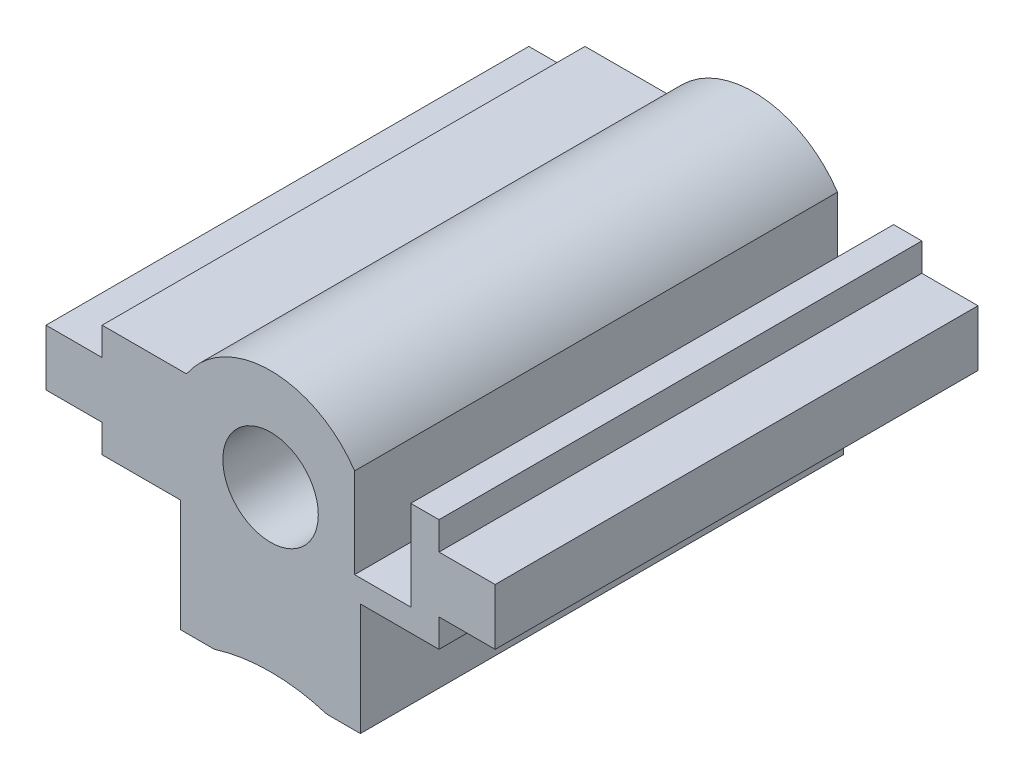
ISO-10303-21;
HEADER;
FILE_DESCRIPTION(('STEP AP214'),'2;1');
FILE_NAME('part.step','',(''),(''),'','','');
FILE_SCHEMA(('AUTOMOTIVE_DESIGN { 1 0 10303 214 1 1 1 1 }'));
ENDSEC;
DATA;
#1=APPLICATION_CONTEXT('core data for automotive mechanical design processes');
#2=APPLICATION_PROTOCOL_DEFINITION('international standard','automotive_design',2000,#1);
#3=PRODUCT_CONTEXT('',#1,'mechanical');
#4=PRODUCT('Part','Part','',(#3));
#5=PRODUCT_RELATED_PRODUCT_CATEGORY('part','',(#4));
#6=PRODUCT_DEFINITION_FORMATION('','',#4);
#7=PRODUCT_DEFINITION_CONTEXT('part definition',#1,'design');
#8=PRODUCT_DEFINITION('design','',#6,#7);
#9=PRODUCT_DEFINITION_SHAPE('','',#8);
#10=(LENGTH_UNIT() NAMED_UNIT(*) SI_UNIT(.MILLI.,.METRE.));
#11=(NAMED_UNIT(*) PLANE_ANGLE_UNIT() SI_UNIT($,.RADIAN.));
#12=(NAMED_UNIT(*) SI_UNIT($,.STERADIAN.) SOLID_ANGLE_UNIT());
#13=UNCERTAINTY_MEASURE_WITH_UNIT(LENGTH_MEASURE(1.E-05),#10,'distance_accuracy_value','');
#14=(GEOMETRIC_REPRESENTATION_CONTEXT(3) GLOBAL_UNCERTAINTY_ASSIGNED_CONTEXT((#13)) GLOBAL_UNIT_ASSIGNED_CONTEXT((#10,
#11,#12)) REPRESENTATION_CONTEXT('',''));
#15=CARTESIAN_POINT('',(0.,0.,0.));
#16=DIRECTION('',(0.,0.,1.));
#17=DIRECTION('',(1.,0.,0.));
#18=AXIS2_PLACEMENT_3D('',#15,#16,#17);
#19=CARTESIAN_POINT('',(-15.,5.,43.));
#20=DIRECTION('',(0.,-1.,0.));
#21=DIRECTION('',(0.,0.,-1.));
#22=AXIS2_PLACEMENT_3D('',#19,#20,#21);
#23=PLANE('',#22);
#24=DIRECTION('',(0.,0.,-1.));
#25=VECTOR('',#24,1.);
#26=CARTESIAN_POINT('',(-7.48331477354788,5.,58.4919333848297));
#27=LINE('',#26,#25);
#28=CARTESIAN_POINT('',(-7.48331477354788,5.,43.));
#29=VERTEX_POINT('',#28);
#30=CARTESIAN_POINT('',(-7.48331477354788,5.,0.));
#31=VERTEX_POINT('',#30);
#32=EDGE_CURVE('E490',#29,#31,#27,.T.);
#33=ORIENTED_EDGE('',*,*,#32,.T.);
#34=DIRECTION('',(-1.,0.,0.));
#35=VECTOR('',#34,1.);
#36=CARTESIAN_POINT('',(-15.,5.,0.));
#37=LINE('',#36,#35);
#38=CARTESIAN_POINT('',(-15.,5.,0.));
#39=VERTEX_POINT('',#38);
#40=EDGE_CURVE('E282',#31,#39,#37,.T.);
#41=ORIENTED_EDGE('',*,*,#40,.T.);
#42=DIRECTION('',(0.,0.,-1.));
#43=VECTOR('',#42,1.);
#44=CARTESIAN_POINT('',(-15.,5.,43.));
#45=LINE('',#44,#43);
#46=CARTESIAN_POINT('',(-15.,5.,43.));
#47=VERTEX_POINT('',#46);
#48=EDGE_CURVE('E397',#47,#39,#45,.T.);
#49=ORIENTED_EDGE('',*,*,#48,.F.);
#50=DIRECTION('',(-1.,0.,0.));
#51=VECTOR('',#50,1.);
#52=CARTESIAN_POINT('',(-15.,5.,43.));
#53=LINE('',#52,#51);
#54=EDGE_CURVE('E48',#29,#47,#53,.T.);
#55=ORIENTED_EDGE('',*,*,#54,.F.);
#56=EDGE_LOOP('',(#33,#41,#49,#55));
#57=FACE_BOUND('',#56,.T.);
#58=ADVANCED_FACE('F33',(#57),#23,.F.);
#59=CARTESIAN_POINT('',(15.,5.,0.));
#60=VERTEX_POINT('',#59);
#61=CARTESIAN_POINT('',(12.4833147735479,5.,0.));
#62=VERTEX_POINT('',#61);
#63=EDGE_CURVE('E275',#60,#62,#37,.T.);
#64=ORIENTED_EDGE('',*,*,#63,.T.);
#65=DIRECTION('',(0.,0.,1.));
#66=VECTOR('',#65,1.);
#67=CARTESIAN_POINT('',(12.4833147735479,5.,-0.001000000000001));
#68=LINE('',#67,#66);
#69=CARTESIAN_POINT('',(12.4833147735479,5.,43.));
#70=VERTEX_POINT('',#69);
#71=EDGE_CURVE('E255',#62,#70,#68,.T.);
#72=ORIENTED_EDGE('',*,*,#71,.T.);
#73=CARTESIAN_POINT('',(15.,5.,43.));
#74=VERTEX_POINT('',#73);
#75=EDGE_CURVE('E440',#74,#70,#53,.T.);
#76=ORIENTED_EDGE('',*,*,#75,.F.);
#77=DIRECTION('',(0.,0.,-1.));
#78=VECTOR('',#77,1.);
#79=CARTESIAN_POINT('',(15.,5.,43.));
#80=LINE('',#79,#78);
#81=EDGE_CURVE('E280',#74,#60,#80,.T.);
#82=ORIENTED_EDGE('',*,*,#81,.T.);
#83=EDGE_LOOP('',(#64,#72,#76,#82));
#84=FACE_BOUND('',#83,.T.);
#85=ADVANCED_FACE('F278',(#84),#23,.F.);
#86=CARTESIAN_POINT('',(-5.,-12.,43.));
#87=DIRECTION('',(0.,1.,0.));
#88=DIRECTION('',(0.,0.,1.));
#89=AXIS2_PLACEMENT_3D('',#86,#87,#88);
#90=PLANE('',#89);
#91=DIRECTION('',(-1.,0.,0.));
#92=VECTOR('',#91,1.);
#93=CARTESIAN_POINT('',(5.,-12.,3.));
#94=LINE('',#93,#92);
#95=CARTESIAN_POINT('',(-2.,-12.,3.));
#96=VERTEX_POINT('',#95);
#97=CARTESIAN_POINT('',(-5.,-12.,3.));
#98=VERTEX_POINT('',#97);
#99=EDGE_CURVE('E486',#96,#98,#94,.T.);
#100=ORIENTED_EDGE('',*,*,#99,.F.);
#101=DIRECTION('',(0.,0.,-1.));
#102=VECTOR('',#101,1.);
#103=CARTESIAN_POINT('',(-2.,-12.,43.));
#104=LINE('',#103,#102);
#105=CARTESIAN_POINT('',(-2.,-12.,40.));
#106=VERTEX_POINT('',#105);
#107=EDGE_CURVE('E369',#106,#96,#104,.T.);
#108=ORIENTED_EDGE('',*,*,#107,.F.);
#109=DIRECTION('',(1.,0.,0.));
#110=VECTOR('',#109,1.);
#111=CARTESIAN_POINT('',(-5.,-12.,40.));
#112=LINE('',#111,#110);
#113=CARTESIAN_POINT('',(-5.,-12.,40.));
#114=VERTEX_POINT('',#113);
#115=EDGE_CURVE('E448',#114,#106,#112,.T.);
#116=ORIENTED_EDGE('',*,*,#115,.F.);
#117=DIRECTION('',(0.,0.,-1.));
#118=VECTOR('',#117,1.);
#119=CARTESIAN_POINT('',(-5.,-12.,43.));
#120=LINE('',#119,#118);
#121=EDGE_CURVE('E372',#114,#98,#120,.T.);
#122=ORIENTED_EDGE('',*,*,#121,.T.);
#123=EDGE_LOOP('',(#100,#108,#116,#122));
#124=FACE_BOUND('',#123,.T.);
#125=ADVANCED_FACE('F540',(#124),#90,.F.);
#126=CARTESIAN_POINT('',(-2.,-12.,43.));
#127=DIRECTION('',(-1.,0.,0.));
#128=DIRECTION('',(0.,0.,1.));
#129=AXIS2_PLACEMENT_3D('',#126,#127,#128);
#130=PLANE('',#129);
#131=DIRECTION('',(0.,-1.,0.));
#132=VECTOR('',#131,1.);
#133=CARTESIAN_POINT('',(-2.,-12.,3.));
#134=LINE('',#133,#132);
#135=CARTESIAN_POINT('',(-2.,-7.99999999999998,3.));
#136=VERTEX_POINT('',#135);
#137=EDGE_CURVE('E471',#136,#96,#134,.T.);
#138=ORIENTED_EDGE('',*,*,#137,.F.);
#139=DIRECTION('',(0.,0.,-1.));
#140=VECTOR('',#139,1.);
#141=CARTESIAN_POINT('',(-2.,-7.99999999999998,43.));
#142=LINE('',#141,#140);
#143=CARTESIAN_POINT('',(-2.,-7.99999999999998,40.));
#144=VERTEX_POINT('',#143);
#145=EDGE_CURVE('E366',#144,#136,#142,.T.);
#146=ORIENTED_EDGE('',*,*,#145,.F.);
#147=DIRECTION('',(0.,1.,0.));
#148=VECTOR('',#147,1.);
#149=CARTESIAN_POINT('',(-2.,-12.,40.));
#150=LINE('',#149,#148);
#151=EDGE_CURVE('E450',#106,#144,#150,.T.);
#152=ORIENTED_EDGE('',*,*,#151,.F.);
#153=ORIENTED_EDGE('',*,*,#107,.T.);
#154=EDGE_LOOP('',(#138,#146,#152,#153));
#155=FACE_BOUND('',#154,.T.);
#156=ADVANCED_FACE('F675',(#155),#130,.F.);
#157=CARTESIAN_POINT('',(-2.,-7.99999999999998,43.));
#158=DIRECTION('',(0.,-1.,0.));
#159=DIRECTION('',(0.,0.,-1.));
#160=AXIS2_PLACEMENT_3D('',#157,#158,#159);
#161=PLANE('',#160);
#162=DIRECTION('',(1.,0.,0.));
#163=VECTOR('',#162,1.);
#164=CARTESIAN_POINT('',(5.,-7.99999999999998,3.));
#165=LINE('',#164,#163);
#166=CARTESIAN_POINT('',(-5.,-7.99999999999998,3.));
#167=VERTEX_POINT('',#166);
#168=EDGE_CURVE('E479',#167,#136,#165,.T.);
#169=ORIENTED_EDGE('',*,*,#168,.F.);
#170=DIRECTION('',(0.,0.,-1.));
#171=VECTOR('',#170,1.);
#172=CARTESIAN_POINT('',(-5.,-7.99999999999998,43.));
#173=LINE('',#172,#171);
#174=CARTESIAN_POINT('',(-5.,-7.99999999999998,40.));
#175=VERTEX_POINT('',#174);
#176=EDGE_CURVE('E363',#175,#167,#173,.T.);
#177=ORIENTED_EDGE('',*,*,#176,.F.);
#178=DIRECTION('',(-1.,0.,0.));
#179=VECTOR('',#178,1.);
#180=CARTESIAN_POINT('',(-2.,-7.99999999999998,40.));
#181=LINE('',#180,#179);
#182=EDGE_CURVE('E452',#144,#175,#181,.T.);
#183=ORIENTED_EDGE('',*,*,#182,.F.);
#184=ORIENTED_EDGE('',*,*,#145,.T.);
#185=EDGE_LOOP('',(#169,#177,#183,#184));
#186=FACE_BOUND('',#185,.T.);
#187=ADVANCED_FACE('F668',(#186),#161,.F.);
#188=CARTESIAN_POINT('',(2.00000000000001,-7.99999999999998,43.));
#189=DIRECTION('',(0.,-1.,0.));
#190=DIRECTION('',(1.,0.,0.));
#191=AXIS2_PLACEMENT_3D('',#188,#189,#190);
#192=PLANE('',#191);
#193=CARTESIAN_POINT('',(2.00000000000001,-7.99999999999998,3.));
#194=VERTEX_POINT('',#193);
#195=CARTESIAN_POINT('',(5.,-7.99999999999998,3.));
#196=VERTEX_POINT('',#195);
#197=EDGE_CURVE('E481',#194,#196,#165,.T.);
#198=ORIENTED_EDGE('',*,*,#197,.F.);
#199=DIRECTION('',(0.,0.,-1.));
#200=VECTOR('',#199,1.);
#201=CARTESIAN_POINT('',(2.00000000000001,-7.99999999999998,43.));
#202=LINE('',#201,#200);
#203=CARTESIAN_POINT('',(2.00000000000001,-7.99999999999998,40.));
#204=VERTEX_POINT('',#203);
#205=EDGE_CURVE('E352',#204,#194,#202,.T.);
#206=ORIENTED_EDGE('',*,*,#205,.F.);
#207=DIRECTION('',(-1.,0.,0.));
#208=VECTOR('',#207,1.);
#209=CARTESIAN_POINT('',(2.00000000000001,-7.99999999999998,40.));
#210=LINE('',#209,#208);
#211=CARTESIAN_POINT('',(5.,-7.99999999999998,40.));
#212=VERTEX_POINT('',#211);
#213=EDGE_CURVE('E458',#212,#204,#210,.T.);
#214=ORIENTED_EDGE('',*,*,#213,.F.);
#215=DIRECTION('',(0.,0.,-1.));
#216=VECTOR('',#215,1.);
#217=CARTESIAN_POINT('',(5.,-7.99999999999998,43.));
#218=LINE('',#217,#216);
#219=EDGE_CURVE('E355',#212,#196,#218,.T.);
#220=ORIENTED_EDGE('',*,*,#219,.T.);
#221=EDGE_LOOP('',(#198,#206,#214,#220));
#222=FACE_BOUND('',#221,.T.);
#223=ADVANCED_FACE('F661',(#222),#192,.F.);
#224=CARTESIAN_POINT('',(2.00000000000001,-12.,43.));
#225=DIRECTION('',(1.,0.,0.));
#226=DIRECTION('',(0.,1.,0.));
#227=AXIS2_PLACEMENT_3D('',#224,#225,#226);
#228=PLANE('',#227);
#229=DIRECTION('',(0.,1.,0.));
#230=VECTOR('',#229,1.);
#231=CARTESIAN_POINT('',(2.00000000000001,-12.,3.));
#232=LINE('',#231,#230);
#233=CARTESIAN_POINT('',(2.00000000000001,-12.,3.));
#234=VERTEX_POINT('',#233);
#235=EDGE_CURVE('E477',#234,#194,#232,.T.);
#236=ORIENTED_EDGE('',*,*,#235,.F.);
#237=DIRECTION('',(0.,0.,-1.));
#238=VECTOR('',#237,1.);
#239=CARTESIAN_POINT('',(2.00000000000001,-12.,43.));
#240=LINE('',#239,#238);
#241=CARTESIAN_POINT('',(2.00000000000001,-12.,40.));
#242=VERTEX_POINT('',#241);
#243=EDGE_CURVE('E349',#242,#234,#240,.T.);
#244=ORIENTED_EDGE('',*,*,#243,.F.);
#245=DIRECTION('',(0.,-1.,0.));
#246=VECTOR('',#245,1.);
#247=CARTESIAN_POINT('',(2.00000000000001,-12.,40.));
#248=LINE('',#247,#246);
#249=EDGE_CURVE('E460',#204,#242,#248,.T.);
#250=ORIENTED_EDGE('',*,*,#249,.F.);
#251=ORIENTED_EDGE('',*,*,#205,.T.);
#252=EDGE_LOOP('',(#236,#244,#250,#251));
#253=FACE_BOUND('',#252,.T.);
#254=ADVANCED_FACE('F656',(#253),#228,.F.);
#255=CARTESIAN_POINT('',(5.00000000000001,-12.,43.));
#256=DIRECTION('',(0.,1.,0.));
#257=DIRECTION('',(-1.,0.,0.));
#258=AXIS2_PLACEMENT_3D('',#255,#256,#257);
#259=PLANE('',#258);
#260=CARTESIAN_POINT('',(5.,-12.,3.));
#261=VERTEX_POINT('',#260);
#262=EDGE_CURVE('E484',#261,#234,#94,.T.);
#263=ORIENTED_EDGE('',*,*,#262,.F.);
#264=DIRECTION('',(0.,0.,-1.));
#265=VECTOR('',#264,1.);
#266=CARTESIAN_POINT('',(5.00000000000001,-12.,43.));
#267=LINE('',#266,#265);
#268=CARTESIAN_POINT('',(5.00000000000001,-12.,40.));
#269=VERTEX_POINT('',#268);
#270=EDGE_CURVE('E346',#269,#261,#267,.T.);
#271=ORIENTED_EDGE('',*,*,#270,.F.);
#272=DIRECTION('',(1.,0.,0.));
#273=VECTOR('',#272,1.);
#274=CARTESIAN_POINT('',(5.00000000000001,-12.,40.));
#275=LINE('',#274,#273);
#276=EDGE_CURVE('E462',#242,#269,#275,.T.);
#277=ORIENTED_EDGE('',*,*,#276,.F.);
#278=ORIENTED_EDGE('',*,*,#243,.T.);
#279=EDGE_LOOP('',(#263,#271,#277,#278));
#280=FACE_BOUND('',#279,.T.);
#281=ADVANCED_FACE('F649',(#280),#259,.F.);
#282=CARTESIAN_POINT('',(-5.,-7.99999999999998,43.));
#283=DIRECTION('',(-1.,0.,0.));
#284=DIRECTION('',(0.,-1.,0.));
#285=AXIS2_PLACEMENT_3D('',#282,#283,#284);
#286=PLANE('',#285);
#287=DIRECTION('',(0.,1.,0.));
#288=VECTOR('',#287,1.);
#289=CARTESIAN_POINT('',(-5.,-7.99999999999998,40.));
#290=LINE('',#289,#288);
#291=CARTESIAN_POINT('',(-5.,-4.99999999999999,40.));
#292=VERTEX_POINT('',#291);
#293=EDGE_CURVE('E454',#175,#292,#290,.T.);
#294=ORIENTED_EDGE('',*,*,#293,.F.);
#295=ORIENTED_EDGE('',*,*,#176,.T.);
#296=DIRECTION('',(0.,1.,0.));
#297=VECTOR('',#296,1.);
#298=CARTESIAN_POINT('',(-5.,-7.99999999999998,3.));
#299=LINE('',#298,#297);
#300=EDGE_CURVE('E482',#98,#167,#299,.T.);
#301=ORIENTED_EDGE('',*,*,#300,.F.);
#302=ORIENTED_EDGE('',*,*,#121,.F.);
#303=DIRECTION('',(0.,1.,0.));
#304=VECTOR('',#303,1.);
#305=CARTESIAN_POINT('',(-5.,-15.,40.));
#306=LINE('',#305,#304);
#307=CARTESIAN_POINT('',(-5.,-15.,40.));
#308=VERTEX_POINT('',#307);
#309=EDGE_CURVE('E411',#308,#114,#306,.T.);
#310=ORIENTED_EDGE('',*,*,#309,.F.);
#311=DIRECTION('',(0.,0.,-1.));
#312=VECTOR('',#311,1.);
#313=CARTESIAN_POINT('',(-5.,-15.,43.));
#314=LINE('',#313,#312);
#315=CARTESIAN_POINT('',(-5.,-15.,0.));
#316=VERTEX_POINT('',#315);
#317=EDGE_CURVE('E375',#308,#316,#314,.T.);
#318=ORIENTED_EDGE('',*,*,#317,.T.);
#319=DIRECTION('',(0.,1.,0.));
#320=VECTOR('',#319,1.);
#321=CARTESIAN_POINT('',(-5.,-7.99999999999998,0.));
#322=LINE('',#321,#320);
#323=CARTESIAN_POINT('',(-5.,-5.,0.));
#324=VERTEX_POINT('',#323);
#325=EDGE_CURVE('E306',#316,#324,#322,.T.);
#326=ORIENTED_EDGE('',*,*,#325,.T.);
#327=DIRECTION('',(0.,0.,-1.));
#328=VECTOR('',#327,1.);
#329=CARTESIAN_POINT('',(-5.,-5.,43.));
#330=LINE('',#329,#328);
#331=EDGE_CURVE('E361',#292,#324,#330,.T.);
#332=ORIENTED_EDGE('',*,*,#331,.F.);
#333=EDGE_LOOP('',(#294,#295,#301,#302,#310,#318,#326,#332));
#334=FACE_BOUND('',#333,.T.);
#335=ADVANCED_FACE('F597',(#334),#286,.F.);
#336=CARTESIAN_POINT('',(-5.,-5.,43.));
#337=DIRECTION('',(0.,1.,0.));
#338=DIRECTION('',(-1.,0.,0.));
#339=AXIS2_PLACEMENT_3D('',#336,#337,#338);
#340=PLANE('',#339);
#341=DIRECTION('',(-1.,0.,0.));
#342=VECTOR('',#341,1.);
#343=CARTESIAN_POINT('',(-8.,-4.99999999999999,40.));
#344=LINE('',#343,#342);
#345=CARTESIAN_POINT('',(5.,-4.99999999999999,40.));
#346=VERTEX_POINT('',#345);
#347=EDGE_CURVE('E466',#346,#292,#344,.T.);
#348=ORIENTED_EDGE('',*,*,#347,.T.);
#349=ORIENTED_EDGE('',*,*,#331,.T.);
#350=DIRECTION('',(1.,0.,0.));
#351=VECTOR('',#350,1.);
#352=CARTESIAN_POINT('',(-5.,-5.,0.));
#353=LINE('',#352,#351);
#354=CARTESIAN_POINT('',(5.,-4.99999999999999,0.));
#355=VERTEX_POINT('',#354);
#356=EDGE_CURVE('E309',#324,#355,#353,.T.);
#357=ORIENTED_EDGE('',*,*,#356,.T.);
#358=DIRECTION('',(0.,0.,-1.));
#359=VECTOR('',#358,1.);
#360=CARTESIAN_POINT('',(5.,-4.99999999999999,43.));
#361=LINE('',#360,#359);
#362=EDGE_CURVE('E358',#346,#355,#361,.T.);
#363=ORIENTED_EDGE('',*,*,#362,.F.);
#364=EDGE_LOOP('',(#348,#349,#357,#363));
#365=FACE_BOUND('',#364,.T.);
#366=ADVANCED_FACE('F556',(#365),#340,.F.);
#367=CARTESIAN_POINT('',(5.00000000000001,-15.,43.));
#368=DIRECTION('',(1.,0.,0.));
#369=DIRECTION('',(0.,0.,-1.));
#370=AXIS2_PLACEMENT_3D('',#367,#368,#369);
#371=PLANE('',#370);
#372=DIRECTION('',(0.,-1.,0.));
#373=VECTOR('',#372,1.);
#374=CARTESIAN_POINT('',(5.00000000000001,-15.,40.));
#375=LINE('',#374,#373);
#376=CARTESIAN_POINT('',(5.00000000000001,-15.,40.));
#377=VERTEX_POINT('',#376);
#378=EDGE_CURVE('E464',#269,#377,#375,.T.);
#379=ORIENTED_EDGE('',*,*,#378,.F.);
#380=ORIENTED_EDGE('',*,*,#270,.T.);
#381=DIRECTION('',(0.,-1.,0.));
#382=VECTOR('',#381,1.);
#383=CARTESIAN_POINT('',(5.,-7.99999999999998,3.));
#384=LINE('',#383,#382);
#385=EDGE_CURVE('E487',#196,#261,#384,.T.);
#386=ORIENTED_EDGE('',*,*,#385,.F.);
#387=ORIENTED_EDGE('',*,*,#219,.F.);
#388=DIRECTION('',(0.,-1.,0.));
#389=VECTOR('',#388,1.);
#390=CARTESIAN_POINT('',(5.,-7.99999999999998,40.));
#391=LINE('',#390,#389);
#392=EDGE_CURVE('E456',#346,#212,#391,.T.);
#393=ORIENTED_EDGE('',*,*,#392,.F.);
#394=ORIENTED_EDGE('',*,*,#362,.T.);
#395=DIRECTION('',(0.,-1.,0.));
#396=VECTOR('',#395,1.);
#397=CARTESIAN_POINT('',(5.00000000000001,-15.,0.));
#398=LINE('',#397,#396);
#399=CARTESIAN_POINT('',(5.00000000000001,-15.,0.));
#400=VERTEX_POINT('',#399);
#401=EDGE_CURVE('E312',#355,#400,#398,.T.);
#402=ORIENTED_EDGE('',*,*,#401,.T.);
#403=DIRECTION('',(0.,0.,-1.));
#404=VECTOR('',#403,1.);
#405=CARTESIAN_POINT('',(5.00000000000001,-15.,43.));
#406=LINE('',#405,#404);
#407=EDGE_CURVE('E342',#377,#400,#406,.T.);
#408=ORIENTED_EDGE('',*,*,#407,.F.);
#409=EDGE_LOOP('',(#379,#380,#386,#387,#393,#394,#402,#408));
#410=FACE_BOUND('',#409,.T.);
#411=ADVANCED_FACE('F551',(#410),#371,.F.);
#412=CARTESIAN_POINT('',(20.,-2.5,43.));
#413=DIRECTION('',(-1.,0.,0.));
#414=DIRECTION('',(0.,0.,1.));
#415=AXIS2_PLACEMENT_3D('',#412,#413,#414);
#416=PLANE('',#415);
#417=DIRECTION('',(0.,1.,0.));
#418=VECTOR('',#417,1.);
#419=CARTESIAN_POINT('',(20.,-2.5,0.));
#420=LINE('',#419,#418);
#421=CARTESIAN_POINT('',(20.,-2.5,0.));
#422=VERTEX_POINT('',#421);
#423=CARTESIAN_POINT('',(20.,2.5,0.));
#424=VERTEX_POINT('',#423);
#425=EDGE_CURVE('E409',#422,#424,#420,.T.);
#426=ORIENTED_EDGE('',*,*,#425,.T.);
#427=DIRECTION('',(0.,0.,-1.));
#428=VECTOR('',#427,1.);
#429=CARTESIAN_POINT('',(20.,2.5,43.));
#430=LINE('',#429,#428);
#431=CARTESIAN_POINT('',(20.,2.5,43.));
#432=VERTEX_POINT('',#431);
#433=EDGE_CURVE('E11',#432,#424,#430,.T.);
#434=ORIENTED_EDGE('',*,*,#433,.F.);
#435=DIRECTION('',(0.,1.,0.));
#436=VECTOR('',#435,1.);
#437=CARTESIAN_POINT('',(20.,-2.5,43.));
#438=LINE('',#437,#436);
#439=CARTESIAN_POINT('',(20.,-2.5,43.));
#440=VERTEX_POINT('',#439);
#441=EDGE_CURVE('E327',#440,#432,#438,.T.);
#442=ORIENTED_EDGE('',*,*,#441,.F.);
#443=DIRECTION('',(0.,0.,-1.));
#444=VECTOR('',#443,1.);
#445=CARTESIAN_POINT('',(20.,-2.5,43.));
#446=LINE('',#445,#444);
#447=EDGE_CURVE('E328',#440,#422,#446,.T.);
#448=ORIENTED_EDGE('',*,*,#447,.T.);
#449=EDGE_LOOP('',(#426,#434,#442,#448));
#450=FACE_BOUND('',#449,.T.);
#451=ADVANCED_FACE('F35',(#450),#416,.F.);
#452=CARTESIAN_POINT('',(15.,2.5,43.));
#453=DIRECTION('',(0.,-1.,0.));
#454=DIRECTION('',(1.,0.,0.));
#455=AXIS2_PLACEMENT_3D('',#452,#453,#454);
#456=PLANE('',#455);
#457=DIRECTION('',(-1.,0.,0.));
#458=VECTOR('',#457,1.);
#459=CARTESIAN_POINT('',(15.,2.5,0.));
#460=LINE('',#459,#458);
#461=CARTESIAN_POINT('',(15.,2.5,0.));
#462=VERTEX_POINT('',#461);
#463=EDGE_CURVE('E408',#424,#462,#460,.T.);
#464=ORIENTED_EDGE('',*,*,#463,.T.);
#465=DIRECTION('',(0.,0.,-1.));
#466=VECTOR('',#465,1.);
#467=CARTESIAN_POINT('',(15.,2.5,43.));
#468=LINE('',#467,#466);
#469=CARTESIAN_POINT('',(15.,2.5,43.));
#470=VERTEX_POINT('',#469);
#471=EDGE_CURVE('E41',#470,#462,#468,.T.);
#472=ORIENTED_EDGE('',*,*,#471,.F.);
#473=DIRECTION('',(-1.,0.,0.));
#474=VECTOR('',#473,1.);
#475=CARTESIAN_POINT('',(15.,2.5,43.));
#476=LINE('',#475,#474);
#477=EDGE_CURVE('E443',#432,#470,#476,.T.);
#478=ORIENTED_EDGE('',*,*,#477,.F.);
#479=ORIENTED_EDGE('',*,*,#433,.T.);
#480=EDGE_LOOP('',(#464,#472,#478,#479));
#481=FACE_BOUND('',#480,.T.);
#482=ADVANCED_FACE('F546',(#481),#456,.F.);
#483=CARTESIAN_POINT('',(15.,2.5,43.));
#484=DIRECTION('',(-1.,0.,0.));
#485=DIRECTION('',(0.,0.,1.));
#486=AXIS2_PLACEMENT_3D('',#483,#484,#485);
#487=PLANE('',#486);
#488=DIRECTION('',(0.,1.,0.));
#489=VECTOR('',#488,1.);
#490=CARTESIAN_POINT('',(15.,2.5,0.));
#491=LINE('',#490,#489);
#492=EDGE_CURVE('E286',#462,#60,#491,.T.);
#493=ORIENTED_EDGE('',*,*,#492,.T.);
#494=ORIENTED_EDGE('',*,*,#81,.F.);
#495=DIRECTION('',(0.,1.,0.));
#496=VECTOR('',#495,1.);
#497=CARTESIAN_POINT('',(15.,2.5,43.));
#498=LINE('',#497,#496);
#499=EDGE_CURVE('E405',#470,#74,#498,.T.);
#500=ORIENTED_EDGE('',*,*,#499,.F.);
#501=ORIENTED_EDGE('',*,*,#471,.T.);
#502=EDGE_LOOP('',(#493,#494,#500,#501));
#503=FACE_BOUND('',#502,.T.);
#504=ADVANCED_FACE('F404',(#503),#487,.F.);
#505=CARTESIAN_POINT('',(-15.,2.5,43.));
#506=DIRECTION('',(1.,0.,0.));
#507=DIRECTION('',(0.,0.,-1.));
#508=AXIS2_PLACEMENT_3D('',#505,#506,#507);
#509=PLANE('',#508);
#510=DIRECTION('',(0.,-1.,0.));
#511=VECTOR('',#510,1.);
#512=CARTESIAN_POINT('',(-15.,2.5,0.));
#513=LINE('',#512,#511);
#514=CARTESIAN_POINT('',(-15.,2.5,0.));
#515=VERTEX_POINT('',#514);
#516=EDGE_CURVE('E281',#39,#515,#513,.T.);
#517=ORIENTED_EDGE('',*,*,#516,.T.);
#518=DIRECTION('',(0.,0.,-1.));
#519=VECTOR('',#518,1.);
#520=CARTESIAN_POINT('',(-15.,2.5,43.));
#521=LINE('',#520,#519);
#522=CARTESIAN_POINT('',(-15.,2.5,43.));
#523=VERTEX_POINT('',#522);
#524=EDGE_CURVE('E394',#523,#515,#521,.T.);
#525=ORIENTED_EDGE('',*,*,#524,.F.);
#526=DIRECTION('',(0.,-1.,0.));
#527=VECTOR('',#526,1.);
#528=CARTESIAN_POINT('',(-15.,2.5,43.));
#529=LINE('',#528,#527);
#530=EDGE_CURVE('E438',#47,#523,#529,.T.);
#531=ORIENTED_EDGE('',*,*,#530,.F.);
#532=ORIENTED_EDGE('',*,*,#48,.T.);
#533=EDGE_LOOP('',(#517,#525,#531,#532));
#534=FACE_BOUND('',#533,.T.);
#535=ADVANCED_FACE('F543',(#534),#509,.F.);
#536=CARTESIAN_POINT('',(-20.,2.5,43.));
#537=DIRECTION('',(0.,-1.,0.));
#538=DIRECTION('',(1.,0.,0.));
#539=AXIS2_PLACEMENT_3D('',#536,#537,#538);
#540=PLANE('',#539);
#541=DIRECTION('',(-1.,0.,0.));
#542=VECTOR('',#541,1.);
#543=CARTESIAN_POINT('',(-20.,2.5,0.));
#544=LINE('',#543,#542);
#545=CARTESIAN_POINT('',(-20.,2.5,0.));
#546=VERTEX_POINT('',#545);
#547=EDGE_CURVE('E284',#515,#546,#544,.T.);
#548=ORIENTED_EDGE('',*,*,#547,.T.);
#549=DIRECTION('',(0.,0.,-1.));
#550=VECTOR('',#549,1.);
#551=CARTESIAN_POINT('',(-20.,2.5,43.));
#552=LINE('',#551,#550);
#553=CARTESIAN_POINT('',(-20.,2.5,43.));
#554=VERTEX_POINT('',#553);
#555=EDGE_CURVE('E391',#554,#546,#552,.T.);
#556=ORIENTED_EDGE('',*,*,#555,.F.);
#557=DIRECTION('',(-1.,0.,0.));
#558=VECTOR('',#557,1.);
#559=CARTESIAN_POINT('',(-20.,2.5,43.));
#560=LINE('',#559,#558);
#561=EDGE_CURVE('E436',#523,#554,#560,.T.);
#562=ORIENTED_EDGE('',*,*,#561,.F.);
#563=ORIENTED_EDGE('',*,*,#524,.T.);
#564=EDGE_LOOP('',(#548,#556,#562,#563));
#565=FACE_BOUND('',#564,.T.);
#566=ADVANCED_FACE('F634',(#565),#540,.F.);
#567=CARTESIAN_POINT('',(-20.,-2.5,43.));
#568=DIRECTION('',(1.,0.,0.));
#569=DIRECTION('',(0.,0.,-1.));
#570=AXIS2_PLACEMENT_3D('',#567,#568,#569);
#571=PLANE('',#570);
#572=DIRECTION('',(0.,-1.,0.));
#573=VECTOR('',#572,1.);
#574=CARTESIAN_POINT('',(-20.,-2.5,0.));
#575=LINE('',#574,#573);
#576=CARTESIAN_POINT('',(-20.,-2.5,0.));
#577=VERTEX_POINT('',#576);
#578=EDGE_CURVE('E291',#546,#577,#575,.T.);
#579=ORIENTED_EDGE('',*,*,#578,.T.);
#580=DIRECTION('',(0.,0.,-1.));
#581=VECTOR('',#580,1.);
#582=CARTESIAN_POINT('',(-20.,-2.5,43.));
#583=LINE('',#582,#581);
#584=CARTESIAN_POINT('',(-20.,-2.5,43.));
#585=VERTEX_POINT('',#584);
#586=EDGE_CURVE('E388',#585,#577,#583,.T.);
#587=ORIENTED_EDGE('',*,*,#586,.F.);
#588=DIRECTION('',(0.,-1.,0.));
#589=VECTOR('',#588,1.);
#590=CARTESIAN_POINT('',(-20.,-2.5,43.));
#591=LINE('',#590,#589);
#592=EDGE_CURVE('E434',#554,#585,#591,.T.);
#593=ORIENTED_EDGE('',*,*,#592,.F.);
#594=ORIENTED_EDGE('',*,*,#555,.T.);
#595=EDGE_LOOP('',(#579,#587,#593,#594));
#596=FACE_BOUND('',#595,.T.);
#597=ADVANCED_FACE('F630',(#596),#571,.F.);
#598=CARTESIAN_POINT('',(-20.,-2.5,43.));
#599=DIRECTION('',(0.,1.,0.));
#600=DIRECTION('',(0.,0.,1.));
#601=AXIS2_PLACEMENT_3D('',#598,#599,#600);
#602=PLANE('',#601);
#603=DIRECTION('',(1.,0.,0.));
#604=VECTOR('',#603,1.);
#605=CARTESIAN_POINT('',(-20.,-2.5,0.));
#606=LINE('',#605,#604);
#607=CARTESIAN_POINT('',(-15.,-2.5,0.));
#608=VERTEX_POINT('',#607);
#609=EDGE_CURVE('E293',#577,#608,#606,.T.);
#610=ORIENTED_EDGE('',*,*,#609,.T.);
#611=DIRECTION('',(0.,0.,-1.));
#612=VECTOR('',#611,1.);
#613=CARTESIAN_POINT('',(-15.,-2.5,43.));
#614=LINE('',#613,#612);
#615=CARTESIAN_POINT('',(-15.,-2.5,43.));
#616=VERTEX_POINT('',#615);
#617=EDGE_CURVE('E385',#616,#608,#614,.T.);
#618=ORIENTED_EDGE('',*,*,#617,.F.);
#619=DIRECTION('',(1.,0.,0.));
#620=VECTOR('',#619,1.);
#621=CARTESIAN_POINT('',(-20.,-2.5,43.));
#622=LINE('',#621,#620);
#623=EDGE_CURVE('E432',#585,#616,#622,.T.);
#624=ORIENTED_EDGE('',*,*,#623,.F.);
#625=ORIENTED_EDGE('',*,*,#586,.T.);
#626=EDGE_LOOP('',(#610,#618,#624,#625));
#627=FACE_BOUND('',#626,.T.);
#628=ADVANCED_FACE('F625',(#627),#602,.F.);
#629=CARTESIAN_POINT('',(-15.,-5.,43.));
#630=DIRECTION('',(1.,0.,0.));
#631=DIRECTION('',(0.,1.,0.));
#632=AXIS2_PLACEMENT_3D('',#629,#630,#631);
#633=PLANE('',#632);
#634=DIRECTION('',(0.,-1.,0.));
#635=VECTOR('',#634,1.);
#636=CARTESIAN_POINT('',(-15.,-5.,0.));
#637=LINE('',#636,#635);
#638=CARTESIAN_POINT('',(-15.,-5.,0.));
#639=VERTEX_POINT('',#638);
#640=EDGE_CURVE('E295',#608,#639,#637,.T.);
#641=ORIENTED_EDGE('',*,*,#640,.T.);
#642=DIRECTION('',(0.,0.,-1.));
#643=VECTOR('',#642,1.);
#644=CARTESIAN_POINT('',(-15.,-5.,43.));
#645=LINE('',#644,#643);
#646=CARTESIAN_POINT('',(-15.,-5.,43.));
#647=VERTEX_POINT('',#646);
#648=EDGE_CURVE('E382',#647,#639,#645,.T.);
#649=ORIENTED_EDGE('',*,*,#648,.F.);
#650=DIRECTION('',(0.,-1.,0.));
#651=VECTOR('',#650,1.);
#652=CARTESIAN_POINT('',(-15.,-5.,43.));
#653=LINE('',#652,#651);
#654=EDGE_CURVE('E430',#616,#647,#653,.T.);
#655=ORIENTED_EDGE('',*,*,#654,.F.);
#656=ORIENTED_EDGE('',*,*,#617,.T.);
#657=EDGE_LOOP('',(#641,#649,#655,#656));
#658=FACE_BOUND('',#657,.T.);
#659=ADVANCED_FACE('F619',(#658),#633,.F.);
#660=CARTESIAN_POINT('',(-15.,-5.,43.));
#661=DIRECTION('',(0.,1.,0.));
#662=DIRECTION('',(-1.,0.,0.));
#663=AXIS2_PLACEMENT_3D('',#660,#661,#662);
#664=PLANE('',#663);
#665=DIRECTION('',(1.,0.,0.));
#666=VECTOR('',#665,1.);
#667=CARTESIAN_POINT('',(-15.,-5.,0.));
#668=LINE('',#667,#666);
#669=CARTESIAN_POINT('',(-8.,-4.99999999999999,0.));
#670=VERTEX_POINT('',#669);
#671=EDGE_CURVE('E297',#639,#670,#668,.T.);
#672=ORIENTED_EDGE('',*,*,#671,.T.);
#673=DIRECTION('',(0.,0.,-1.));
#674=VECTOR('',#673,1.);
#675=CARTESIAN_POINT('',(-8.,-4.99999999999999,43.));
#676=LINE('',#675,#674);
#677=CARTESIAN_POINT('',(-8.,-4.99999999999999,43.));
#678=VERTEX_POINT('',#677);
#679=EDGE_CURVE('E380',#678,#670,#676,.T.);
#680=ORIENTED_EDGE('',*,*,#679,.F.);
#681=DIRECTION('',(1.,0.,0.));
#682=VECTOR('',#681,1.);
#683=CARTESIAN_POINT('',(-15.,-5.,43.));
#684=LINE('',#683,#682);
#685=EDGE_CURVE('E428',#647,#678,#684,.T.);
#686=ORIENTED_EDGE('',*,*,#685,.F.);
#687=ORIENTED_EDGE('',*,*,#648,.T.);
#688=EDGE_LOOP('',(#672,#680,#686,#687));
#689=FACE_BOUND('',#688,.T.);
#690=ADVANCED_FACE('F615',(#689),#664,.F.);
#691=CARTESIAN_POINT('',(-8.,-4.99999999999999,43.));
#692=DIRECTION('',(1.,0.,0.));
#693=DIRECTION('',(0.,1.,0.));
#694=AXIS2_PLACEMENT_3D('',#691,#692,#693);
#695=PLANE('',#694);
#696=ORIENTED_EDGE('',*,*,#679,.T.);
#697=DIRECTION('',(0.,-1.,0.));
#698=VECTOR('',#697,1.);
#699=CARTESIAN_POINT('',(-8.,-4.99999999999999,0.));
#700=LINE('',#699,#698);
#701=CARTESIAN_POINT('',(-7.99999999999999,-15.,0.));
#702=VERTEX_POINT('',#701);
#703=EDGE_CURVE('E300',#670,#702,#700,.T.);
#704=ORIENTED_EDGE('',*,*,#703,.T.);
#705=DIRECTION('',(0.,0.,-1.));
#706=VECTOR('',#705,1.);
#707=CARTESIAN_POINT('',(-7.99999999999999,-15.,43.));
#708=LINE('',#707,#706);
#709=CARTESIAN_POINT('',(-7.99999999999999,-15.,43.));
#710=VERTEX_POINT('',#709);
#711=EDGE_CURVE('E378',#710,#702,#708,.T.);
#712=ORIENTED_EDGE('',*,*,#711,.F.);
#713=DIRECTION('',(0.,-1.,0.));
#714=VECTOR('',#713,1.);
#715=CARTESIAN_POINT('',(-8.,-4.99999999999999,43.));
#716=LINE('',#715,#714);
#717=EDGE_CURVE('E426',#678,#710,#716,.T.);
#718=ORIENTED_EDGE('',*,*,#717,.F.);
#719=EDGE_LOOP('',(#696,#704,#712,#718));
#720=FACE_BOUND('',#719,.T.);
#721=ADVANCED_FACE('F610',(#720),#695,.F.);
#722=CARTESIAN_POINT('',(-7.99999999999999,-15.,43.));
#723=DIRECTION('',(0.,1.,0.));
#724=DIRECTION('',(0.,0.,1.));
#725=AXIS2_PLACEMENT_3D('',#722,#723,#724);
#726=PLANE('',#725);
#727=ORIENTED_EDGE('',*,*,#711,.T.);
#728=DIRECTION('',(1.,0.,0.));
#729=VECTOR('',#728,1.);
#730=CARTESIAN_POINT('',(-7.99999999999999,-15.,0.));
#731=LINE('',#730,#729);
#732=EDGE_CURVE('E303',#702,#316,#731,.T.);
#733=ORIENTED_EDGE('',*,*,#732,.T.);
#734=ORIENTED_EDGE('',*,*,#317,.F.);
#735=CARTESIAN_POINT('',(-5.,-15.,43.));
#736=VERTEX_POINT('',#735);
#737=EDGE_CURVE('E376',#736,#308,#314,.T.);
#738=ORIENTED_EDGE('',*,*,#737,.F.);
#739=DIRECTION('',(1.,0.,0.));
#740=VECTOR('',#739,1.);
#741=CARTESIAN_POINT('',(-7.99999999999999,-15.,43.));
#742=LINE('',#741,#740);
#743=EDGE_CURVE('E423',#710,#736,#742,.T.);
#744=ORIENTED_EDGE('',*,*,#743,.F.);
#745=EDGE_LOOP('',(#727,#733,#734,#738,#744));
#746=FACE_BOUND('',#745,.T.);
#747=ADVANCED_FACE('F603',(#746),#726,.F.);
#748=CARTESIAN_POINT('',(8.00000000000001,-15.,43.));
#749=DIRECTION('',(0.,1.,0.));
#750=DIRECTION('',(0.,0.,1.));
#751=AXIS2_PLACEMENT_3D('',#748,#749,#750);
#752=PLANE('',#751);
#753=CARTESIAN_POINT('',(5.00000000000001,-15.,43.));
#754=VERTEX_POINT('',#753);
#755=EDGE_CURVE('E343',#754,#377,#406,.T.);
#756=ORIENTED_EDGE('',*,*,#755,.T.);
#757=ORIENTED_EDGE('',*,*,#407,.T.);
#758=DIRECTION('',(1.,0.,0.));
#759=VECTOR('',#758,1.);
#760=CARTESIAN_POINT('',(8.00000000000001,-15.,0.));
#761=LINE('',#760,#759);
#762=CARTESIAN_POINT('',(8.00000000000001,-15.,0.));
#763=VERTEX_POINT('',#762);
#764=EDGE_CURVE('E315',#400,#763,#761,.T.);
#765=ORIENTED_EDGE('',*,*,#764,.T.);
#766=DIRECTION('',(0.,0.,-1.));
#767=VECTOR('',#766,1.);
#768=CARTESIAN_POINT('',(8.00000000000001,-15.,43.));
#769=LINE('',#768,#767);
#770=CARTESIAN_POINT('',(8.00000000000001,-15.,43.));
#771=VERTEX_POINT('',#770);
#772=EDGE_CURVE('E340',#771,#763,#769,.T.);
#773=ORIENTED_EDGE('',*,*,#772,.F.);
#774=DIRECTION('',(1.,0.,0.));
#775=VECTOR('',#774,1.);
#776=CARTESIAN_POINT('',(8.00000000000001,-15.,43.));
#777=LINE('',#776,#775);
#778=EDGE_CURVE('E421',#754,#771,#777,.T.);
#779=ORIENTED_EDGE('',*,*,#778,.F.);
#780=EDGE_LOOP('',(#756,#757,#765,#773,#779));
#781=FACE_BOUND('',#780,.T.);
#782=ADVANCED_FACE('F585',(#781),#752,.F.);
#783=CARTESIAN_POINT('',(8.,-4.99999999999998,43.));
#784=DIRECTION('',(-1.,0.,0.));
#785=DIRECTION('',(0.,-1.,0.));
#786=AXIS2_PLACEMENT_3D('',#783,#784,#785);
#787=PLANE('',#786);
#788=ORIENTED_EDGE('',*,*,#772,.T.);
#789=DIRECTION('',(0.,1.,0.));
#790=VECTOR('',#789,1.);
#791=CARTESIAN_POINT('',(8.,-4.99999999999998,0.));
#792=LINE('',#791,#790);
#793=CARTESIAN_POINT('',(8.,-4.99999999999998,0.));
#794=VERTEX_POINT('',#793);
#795=EDGE_CURVE('E318',#763,#794,#792,.T.);
#796=ORIENTED_EDGE('',*,*,#795,.T.);
#797=DIRECTION('',(0.,0.,-1.));
#798=VECTOR('',#797,1.);
#799=CARTESIAN_POINT('',(8.,-4.99999999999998,43.));
#800=LINE('',#799,#798);
#801=CARTESIAN_POINT('',(8.,-4.99999999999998,43.));
#802=VERTEX_POINT('',#801);
#803=EDGE_CURVE('E338',#802,#794,#800,.T.);
#804=ORIENTED_EDGE('',*,*,#803,.F.);
#805=DIRECTION('',(0.,1.,0.));
#806=VECTOR('',#805,1.);
#807=CARTESIAN_POINT('',(8.,-4.99999999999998,43.));
#808=LINE('',#807,#806);
#809=EDGE_CURVE('E419',#771,#802,#808,.T.);
#810=ORIENTED_EDGE('',*,*,#809,.F.);
#811=EDGE_LOOP('',(#788,#796,#804,#810));
#812=FACE_BOUND('',#811,.T.);
#813=ADVANCED_FACE('F580',(#812),#787,.F.);
#814=CARTESIAN_POINT('',(8.,-4.99999999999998,43.));
#815=DIRECTION('',(0.,1.,0.));
#816=DIRECTION('',(-1.,0.,0.));
#817=AXIS2_PLACEMENT_3D('',#814,#815,#816);
#818=PLANE('',#817);
#819=DIRECTION('',(1.,0.,0.));
#820=VECTOR('',#819,1.);
#821=CARTESIAN_POINT('',(8.,-4.99999999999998,0.));
#822=LINE('',#821,#820);
#823=CARTESIAN_POINT('',(15.,-5.,0.));
#824=VERTEX_POINT('',#823);
#825=EDGE_CURVE('E321',#794,#824,#822,.T.);
#826=ORIENTED_EDGE('',*,*,#825,.T.);
#827=DIRECTION('',(0.,0.,-1.));
#828=VECTOR('',#827,1.);
#829=CARTESIAN_POINT('',(15.,-5.,43.));
#830=LINE('',#829,#828);
#831=CARTESIAN_POINT('',(15.,-5.,43.));
#832=VERTEX_POINT('',#831);
#833=EDGE_CURVE('E335',#832,#824,#830,.T.);
#834=ORIENTED_EDGE('',*,*,#833,.F.);
#835=DIRECTION('',(1.,0.,0.));
#836=VECTOR('',#835,1.);
#837=CARTESIAN_POINT('',(8.,-4.99999999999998,43.));
#838=LINE('',#837,#836);
#839=EDGE_CURVE('E417',#802,#832,#838,.T.);
#840=ORIENTED_EDGE('',*,*,#839,.F.);
#841=ORIENTED_EDGE('',*,*,#803,.T.);
#842=EDGE_LOOP('',(#826,#834,#840,#841));
#843=FACE_BOUND('',#842,.T.);
#844=ADVANCED_FACE('F575',(#843),#818,.F.);
#845=CARTESIAN_POINT('',(15.,-5.,43.));
#846=DIRECTION('',(-1.,0.,0.));
#847=DIRECTION('',(0.,0.,1.));
#848=AXIS2_PLACEMENT_3D('',#845,#846,#847);
#849=PLANE('',#848);
#850=DIRECTION('',(0.,1.,0.));
#851=VECTOR('',#850,1.);
#852=CARTESIAN_POINT('',(15.,-5.,0.));
#853=LINE('',#852,#851);
#854=CARTESIAN_POINT('',(15.,-2.5,0.));
#855=VERTEX_POINT('',#854);
#856=EDGE_CURVE('E323',#824,#855,#853,.T.);
#857=ORIENTED_EDGE('',*,*,#856,.T.);
#858=DIRECTION('',(0.,0.,-1.));
#859=VECTOR('',#858,1.);
#860=CARTESIAN_POINT('',(15.,-2.5,43.));
#861=LINE('',#860,#859);
#862=CARTESIAN_POINT('',(15.,-2.5,43.));
#863=VERTEX_POINT('',#862);
#864=EDGE_CURVE('E331',#863,#855,#861,.T.);
#865=ORIENTED_EDGE('',*,*,#864,.F.);
#866=DIRECTION('',(0.,1.,0.));
#867=VECTOR('',#866,1.);
#868=CARTESIAN_POINT('',(15.,-5.,43.));
#869=LINE('',#868,#867);
#870=EDGE_CURVE('E415',#832,#863,#869,.T.);
#871=ORIENTED_EDGE('',*,*,#870,.F.);
#872=ORIENTED_EDGE('',*,*,#833,.T.);
#873=EDGE_LOOP('',(#857,#865,#871,#872));
#874=FACE_BOUND('',#873,.T.);
#875=ADVANCED_FACE('F571',(#874),#849,.F.);
#876=CARTESIAN_POINT('',(15.,-2.5,43.));
#877=DIRECTION('',(0.,1.,0.));
#878=DIRECTION('',(0.,0.,1.));
#879=AXIS2_PLACEMENT_3D('',#876,#877,#878);
#880=PLANE('',#879);
#881=DIRECTION('',(1.,0.,0.));
#882=VECTOR('',#881,1.);
#883=CARTESIAN_POINT('',(15.,-2.5,0.));
#884=LINE('',#883,#882);
#885=EDGE_CURVE('E325',#855,#422,#884,.T.);
#886=ORIENTED_EDGE('',*,*,#885,.T.);
#887=ORIENTED_EDGE('',*,*,#447,.F.);
#888=DIRECTION('',(1.,0.,0.));
#889=VECTOR('',#888,1.);
#890=CARTESIAN_POINT('',(15.,-2.5,43.));
#891=LINE('',#890,#889);
#892=EDGE_CURVE('E332',#863,#440,#891,.T.);
#893=ORIENTED_EDGE('',*,*,#892,.F.);
#894=ORIENTED_EDGE('',*,*,#864,.T.);
#895=EDGE_LOOP('',(#886,#887,#893,#894));
#896=FACE_BOUND('',#895,.T.);
#897=ADVANCED_FACE('F566',(#896),#880,.F.);
#898=CARTESIAN_POINT('',(0.,0.,43.));
#899=DIRECTION('',(0.,0.,-1.));
#900=DIRECTION('',(-1.,0.,0.));
#901=AXIS2_PLACEMENT_3D('',#898,#899,#900);
#902=PLANE('',#901);
#903=CARTESIAN_POINT('',(0.,0.,43.));
#904=DIRECTION('',(0.,0.,1.));
#905=DIRECTION('',(1.,0.,0.));
#906=AXIS2_PLACEMENT_3D('',#903,#904,#905);
#907=CIRCLE('',#906,4.25);
#908=CARTESIAN_POINT('',(4.25,0.,43.));
#909=VERTEX_POINT('',#908);
#910=EDGE_CURVE('E497',#909,#909,#907,.T.);
#911=ORIENTED_EDGE('',*,*,#910,.F.);
#912=EDGE_LOOP('',(#911));
#913=FACE_BOUND('',#912,.T.);
#914=DIRECTION('',(1.,0.,0.));
#915=VECTOR('',#914,1.);
#916=CARTESIAN_POINT('',(7.48331477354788,-3.,43.));
#917=LINE('',#916,#915);
#918=CARTESIAN_POINT('',(7.48331477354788,-3.,43.));
#919=VERTEX_POINT('',#918);
#920=CARTESIAN_POINT('',(12.4833147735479,-3.,43.));
#921=VERTEX_POINT('',#920);
#922=EDGE_CURVE('E510',#919,#921,#917,.T.);
#923=ORIENTED_EDGE('',*,*,#922,.F.);
#924=DIRECTION('',(0.,-1.,0.));
#925=VECTOR('',#924,1.);
#926=CARTESIAN_POINT('',(7.48331477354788,5.,43.));
#927=LINE('',#926,#925);
#928=CARTESIAN_POINT('',(7.48331477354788,5.,43.));
#929=VERTEX_POINT('',#928);
#930=EDGE_CURVE('E513',#929,#919,#927,.T.);
#931=ORIENTED_EDGE('',*,*,#930,.F.);
#932=CARTESIAN_POINT('',(0.,0.,43.));
#933=DIRECTION('',(0.,0.,-1.));
#934=DIRECTION('',(-1.,0.,0.));
#935=AXIS2_PLACEMENT_3D('',#932,#933,#934);
#936=CIRCLE('',#935,9.);
#937=EDGE_CURVE('E489',#29,#929,#936,.T.);
#938=ORIENTED_EDGE('',*,*,#937,.F.);
#939=ORIENTED_EDGE('',*,*,#54,.T.);
#940=ORIENTED_EDGE('',*,*,#530,.T.);
#941=ORIENTED_EDGE('',*,*,#561,.T.);
#942=ORIENTED_EDGE('',*,*,#592,.T.);
#943=ORIENTED_EDGE('',*,*,#623,.T.);
#944=ORIENTED_EDGE('',*,*,#654,.T.);
#945=ORIENTED_EDGE('',*,*,#685,.T.);
#946=ORIENTED_EDGE('',*,*,#717,.T.);
#947=ORIENTED_EDGE('',*,*,#743,.T.);
#948=CARTESIAN_POINT('',(0.,-30.9863222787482,43.));
#949=DIRECTION('',(0.,0.,-1.));
#950=DIRECTION('',(1.,0.,0.));
#951=AXIS2_PLACEMENT_3D('',#948,#949,#950);
#952=CIRCLE('',#951,16.75);
#953=EDGE_CURVE('E467',#736,#754,#952,.T.);
#954=ORIENTED_EDGE('',*,*,#953,.T.);
#955=ORIENTED_EDGE('',*,*,#778,.T.);
#956=ORIENTED_EDGE('',*,*,#809,.T.);
#957=ORIENTED_EDGE('',*,*,#839,.T.);
#958=ORIENTED_EDGE('',*,*,#870,.T.);
#959=ORIENTED_EDGE('',*,*,#892,.T.);
#960=ORIENTED_EDGE('',*,*,#441,.T.);
#961=ORIENTED_EDGE('',*,*,#477,.T.);
#962=ORIENTED_EDGE('',*,*,#499,.T.);
#963=ORIENTED_EDGE('',*,*,#75,.T.);
#964=DIRECTION('',(0.,1.,0.));
#965=VECTOR('',#964,1.);
#966=CARTESIAN_POINT('',(12.4833147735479,5.,43.));
#967=LINE('',#966,#965);
#968=EDGE_CURVE('E261',#921,#70,#967,.T.);
#969=ORIENTED_EDGE('',*,*,#968,.F.);
#970=EDGE_LOOP('',(#923,#931,#938,#939,#940,#941,#942,#943,#944,#945,#946,#947,#954,#955,#956,
#957,#958,#959,#960,#961,#962,#963,#969));
#971=FACE_BOUND('',#970,.T.);
#972=ADVANCED_FACE('F525',(#913,#971),#902,.F.);
#973=CARTESIAN_POINT('',(0.,0.,0.));
#974=DIRECTION('',(0.,0.,-1.));
#975=DIRECTION('',(-1.,0.,0.));
#976=AXIS2_PLACEMENT_3D('',#973,#974,#975);
#977=PLANE('',#976);
#978=DIRECTION('',(0.,-1.,0.));
#979=VECTOR('',#978,1.);
#980=CARTESIAN_POINT('',(7.48331477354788,5.,0.));
#981=LINE('',#980,#979);
#982=CARTESIAN_POINT('',(7.48331477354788,5.,0.));
#983=VERTEX_POINT('',#982);
#984=CARTESIAN_POINT('',(7.48331477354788,-3.,0.));
#985=VERTEX_POINT('',#984);
#986=EDGE_CURVE('E56',#983,#985,#981,.T.);
#987=ORIENTED_EDGE('',*,*,#986,.T.);
#988=DIRECTION('',(1.,0.,0.));
#989=VECTOR('',#988,1.);
#990=CARTESIAN_POINT('',(7.48331477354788,-3.,0.));
#991=LINE('',#990,#989);
#992=CARTESIAN_POINT('',(12.4833147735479,-3.,0.));
#993=VERTEX_POINT('',#992);
#994=EDGE_CURVE('E266',#985,#993,#991,.T.);
#995=ORIENTED_EDGE('',*,*,#994,.T.);
#996=DIRECTION('',(0.,1.,0.));
#997=VECTOR('',#996,1.);
#998=CARTESIAN_POINT('',(12.4833147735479,5.,0.));
#999=LINE('',#998,#997);
#1000=EDGE_CURVE('E258',#993,#62,#999,.T.);
#1001=ORIENTED_EDGE('',*,*,#1000,.T.);
#1002=ORIENTED_EDGE('',*,*,#63,.F.);
#1003=ORIENTED_EDGE('',*,*,#492,.F.);
#1004=ORIENTED_EDGE('',*,*,#463,.F.);
#1005=ORIENTED_EDGE('',*,*,#425,.F.);
#1006=ORIENTED_EDGE('',*,*,#885,.F.);
#1007=ORIENTED_EDGE('',*,*,#856,.F.);
#1008=ORIENTED_EDGE('',*,*,#825,.F.);
#1009=ORIENTED_EDGE('',*,*,#795,.F.);
#1010=ORIENTED_EDGE('',*,*,#764,.F.);
#1011=ORIENTED_EDGE('',*,*,#401,.F.);
#1012=ORIENTED_EDGE('',*,*,#356,.F.);
#1013=ORIENTED_EDGE('',*,*,#325,.F.);
#1014=ORIENTED_EDGE('',*,*,#732,.F.);
#1015=ORIENTED_EDGE('',*,*,#703,.F.);
#1016=ORIENTED_EDGE('',*,*,#671,.F.);
#1017=ORIENTED_EDGE('',*,*,#640,.F.);
#1018=ORIENTED_EDGE('',*,*,#609,.F.);
#1019=ORIENTED_EDGE('',*,*,#578,.F.);
#1020=ORIENTED_EDGE('',*,*,#547,.F.);
#1021=ORIENTED_EDGE('',*,*,#516,.F.);
#1022=ORIENTED_EDGE('',*,*,#40,.F.);
#1023=CARTESIAN_POINT('',(0.,0.,0.));
#1024=DIRECTION('',(0.,0.,1.));
#1025=DIRECTION('',(1.,0.,0.));
#1026=AXIS2_PLACEMENT_3D('',#1023,#1024,#1025);
#1027=CIRCLE('',#1026,9.);
#1028=EDGE_CURVE('E494',#983,#31,#1027,.T.);
#1029=ORIENTED_EDGE('',*,*,#1028,.F.);
#1030=EDGE_LOOP('',(#987,#995,#1001,#1002,#1003,#1004,#1005,#1006,#1007,#1008,#1009,#1010,#1011,
#1012,#1013,#1014,#1015,#1016,#1017,#1018,#1019,#1020,#1021,#1022,#1029));
#1031=FACE_BOUND('',#1030,.T.);
#1032=CARTESIAN_POINT('',(0.,0.,0.));
#1033=DIRECTION('',(0.,0.,-1.));
#1034=DIRECTION('',(-1.,0.,0.));
#1035=AXIS2_PLACEMENT_3D('',#1032,#1033,#1034);
#1036=CIRCLE('',#1035,4.25);
#1037=CARTESIAN_POINT('',(-4.25,0.,0.));
#1038=VERTEX_POINT('',#1037);
#1039=EDGE_CURVE('E500',#1038,#1038,#1036,.F.);
#1040=ORIENTED_EDGE('',*,*,#1039,.T.);
#1041=EDGE_LOOP('',(#1040));
#1042=FACE_BOUND('',#1041,.T.);
#1043=ADVANCED_FACE('F272',(#1031,#1042),#977,.T.);
#1044=CARTESIAN_POINT('',(0.,-30.9863222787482,40.));
#1045=DIRECTION('',(0.,0.,1.));
#1046=DIRECTION('',(1.,0.,0.));
#1047=AXIS2_PLACEMENT_3D('',#1044,#1045,#1046);
#1048=PLANE('',#1047);
#1049=CARTESIAN_POINT('',(0.,-30.9863222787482,40.));
#1050=DIRECTION('',(0.,0.,-1.));
#1051=DIRECTION('',(1.,0.,0.));
#1052=AXIS2_PLACEMENT_3D('',#1049,#1050,#1051);
#1053=CIRCLE('',#1052,16.75);
#1054=EDGE_CURVE('E470',#308,#377,#1053,.T.);
#1055=ORIENTED_EDGE('',*,*,#1054,.F.);
#1056=ORIENTED_EDGE('',*,*,#309,.T.);
#1057=ORIENTED_EDGE('',*,*,#115,.T.);
#1058=ORIENTED_EDGE('',*,*,#151,.T.);
#1059=ORIENTED_EDGE('',*,*,#182,.T.);
#1060=ORIENTED_EDGE('',*,*,#293,.T.);
#1061=ORIENTED_EDGE('',*,*,#347,.F.);
#1062=ORIENTED_EDGE('',*,*,#392,.T.);
#1063=ORIENTED_EDGE('',*,*,#213,.T.);
#1064=ORIENTED_EDGE('',*,*,#249,.T.);
#1065=ORIENTED_EDGE('',*,*,#276,.T.);
#1066=ORIENTED_EDGE('',*,*,#378,.T.);
#1067=EDGE_LOOP('',(#1055,#1056,#1057,#1058,#1059,#1060,#1061,#1062,#1063,#1064,#1065,#1066));
#1068=FACE_BOUND('',#1067,.T.);
#1069=ADVANCED_FACE('F642',(#1068),#1048,.F.);
#1070=CARTESIAN_POINT('',(0.,-30.9863222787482,40.));
#1071=DIRECTION('',(0.,0.,1.));
#1072=DIRECTION('',(1.,0.,0.));
#1073=AXIS2_PLACEMENT_3D('',#1070,#1071,#1072);
#1074=CYLINDRICAL_SURFACE('',#1073,16.75);
#1075=ORIENTED_EDGE('',*,*,#953,.F.);
#1076=ORIENTED_EDGE('',*,*,#737,.T.);
#1077=ORIENTED_EDGE('',*,*,#1054,.T.);
#1078=ORIENTED_EDGE('',*,*,#755,.F.);
#1079=EDGE_LOOP('',(#1075,#1076,#1077,#1078));
#1080=FACE_BOUND('',#1079,.T.);
#1081=ADVANCED_FACE('F640',(#1080),#1074,.F.);
#1082=CARTESIAN_POINT('',(0.,0.,3.));
#1083=DIRECTION('',(0.,0.,-1.));
#1084=DIRECTION('',(-1.,0.,0.));
#1085=AXIS2_PLACEMENT_3D('',#1082,#1083,#1084);
#1086=PLANE('',#1085);
#1087=ORIENTED_EDGE('',*,*,#137,.T.);
#1088=ORIENTED_EDGE('',*,*,#99,.T.);
#1089=ORIENTED_EDGE('',*,*,#300,.T.);
#1090=ORIENTED_EDGE('',*,*,#168,.T.);
#1091=EDGE_LOOP('',(#1087,#1088,#1089,#1090));
#1092=FACE_BOUND('',#1091,.T.);
#1093=ADVANCED_FACE('F672',(#1092),#1086,.T.);
#1094=ORIENTED_EDGE('',*,*,#235,.T.);
#1095=ORIENTED_EDGE('',*,*,#197,.T.);
#1096=ORIENTED_EDGE('',*,*,#385,.T.);
#1097=ORIENTED_EDGE('',*,*,#262,.T.);
#1098=EDGE_LOOP('',(#1094,#1095,#1096,#1097));
#1099=FACE_BOUND('',#1098,.T.);
#1100=ADVANCED_FACE('F653',(#1099),#1086,.T.);
#1101=CARTESIAN_POINT('',(0.,0.,58.4919333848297));
#1102=DIRECTION('',(0.,0.,-1.));
#1103=DIRECTION('',(-1.,0.,0.));
#1104=AXIS2_PLACEMENT_3D('',#1101,#1102,#1103);
#1105=CYLINDRICAL_SURFACE('',#1104,9.);
#1106=ORIENTED_EDGE('',*,*,#32,.F.);
#1107=ORIENTED_EDGE('',*,*,#937,.T.);
#1108=DIRECTION('',(0.,0.,-1.));
#1109=VECTOR('',#1108,1.);
#1110=CARTESIAN_POINT('',(7.48331477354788,5.,58.4919333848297));
#1111=LINE('',#1110,#1109);
#1112=EDGE_CURVE('E492',#929,#983,#1111,.T.);
#1113=ORIENTED_EDGE('',*,*,#1112,.T.);
#1114=ORIENTED_EDGE('',*,*,#1028,.T.);
#1115=EDGE_LOOP('',(#1106,#1107,#1113,#1114));
#1116=FACE_BOUND('',#1115,.T.);
#1117=ADVANCED_FACE('F520',(#1116),#1105,.T.);
#1118=CARTESIAN_POINT('',(0.,0.,-0.001000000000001));
#1119=DIRECTION('',(0.,0.,1.));
#1120=DIRECTION('',(1.,0.,0.));
#1121=AXIS2_PLACEMENT_3D('',#1118,#1119,#1120);
#1122=CYLINDRICAL_SURFACE('',#1121,4.25);
#1123=ORIENTED_EDGE('',*,*,#1039,.F.);
#1124=EDGE_LOOP('',(#1123));
#1125=FACE_BOUND('',#1124,.T.);
#1126=ORIENTED_EDGE('',*,*,#910,.T.);
#1127=EDGE_LOOP('',(#1126));
#1128=FACE_BOUND('',#1127,.T.);
#1129=ADVANCED_FACE('F881',(#1125,#1128),#1122,.F.);
#1130=CARTESIAN_POINT('',(7.48331477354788,5.,-0.001000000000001));
#1131=DIRECTION('',(-1.,0.,0.));
#1132=DIRECTION('',(0.,-1.,0.));
#1133=AXIS2_PLACEMENT_3D('',#1130,#1131,#1132);
#1134=PLANE('',#1133);
#1135=ORIENTED_EDGE('',*,*,#1112,.F.);
#1136=ORIENTED_EDGE('',*,*,#930,.T.);
#1137=DIRECTION('',(0.,0.,1.));
#1138=VECTOR('',#1137,1.);
#1139=CARTESIAN_POINT('',(7.48331477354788,-3.,-0.001000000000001));
#1140=LINE('',#1139,#1138);
#1141=EDGE_CURVE('E506',#985,#919,#1140,.T.);
#1142=ORIENTED_EDGE('',*,*,#1141,.F.);
#1143=ORIENTED_EDGE('',*,*,#986,.F.);
#1144=EDGE_LOOP('',(#1135,#1136,#1142,#1143));
#1145=FACE_BOUND('',#1144,.T.);
#1146=ADVANCED_FACE('F522',(#1145),#1134,.F.);
#1147=CARTESIAN_POINT('',(12.4833147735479,5.,-0.001000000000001));
#1148=DIRECTION('',(1.,0.,0.));
#1149=DIRECTION('',(0.,1.,0.));
#1150=AXIS2_PLACEMENT_3D('',#1147,#1148,#1149);
#1151=PLANE('',#1150);
#1152=DIRECTION('',(0.,0.,1.));
#1153=VECTOR('',#1152,1.);
#1154=CARTESIAN_POINT('',(12.4833147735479,-3.,-0.001000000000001));
#1155=LINE('',#1154,#1153);
#1156=EDGE_CURVE('E267',#993,#921,#1155,.T.);
#1157=ORIENTED_EDGE('',*,*,#1156,.T.);
#1158=ORIENTED_EDGE('',*,*,#968,.T.);
#1159=ORIENTED_EDGE('',*,*,#71,.F.);
#1160=ORIENTED_EDGE('',*,*,#1000,.F.);
#1161=EDGE_LOOP('',(#1157,#1158,#1159,#1160));
#1162=FACE_BOUND('',#1161,.T.);
#1163=ADVANCED_FACE('F257',(#1162),#1151,.F.);
#1164=CARTESIAN_POINT('',(7.48331477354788,-3.,-0.001000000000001));
#1165=DIRECTION('',(0.,-1.,0.));
#1166=DIRECTION('',(1.,0.,0.));
#1167=AXIS2_PLACEMENT_3D('',#1164,#1165,#1166);
#1168=PLANE('',#1167);
#1169=ORIENTED_EDGE('',*,*,#1141,.T.);
#1170=ORIENTED_EDGE('',*,*,#922,.T.);
#1171=ORIENTED_EDGE('',*,*,#1156,.F.);
#1172=ORIENTED_EDGE('',*,*,#994,.F.);
#1173=EDGE_LOOP('',(#1169,#1170,#1171,#1172));
#1174=FACE_BOUND('',#1173,.T.);
#1175=ADVANCED_FACE('F527',(#1174),#1168,.F.);
#1176=CLOSED_SHELL('',(#58,#85,#125,#156,#187,#223,#254,#281,#335,#366,#411,#451,#482,#504,#535,
#566,#597,#628,#659,#690,#721,#747,#782,#813,#844,#875,#897,#972,#1043,#1069,#1081,#1093,#1100,
#1117,#1129,#1146,#1163,#1175));
#1177=MANIFOLD_SOLID_BREP('B2',#1176);
#1178=ADVANCED_BREP_SHAPE_REPRESENTATION('',(#18,#1177),#14);
#1179=SHAPE_DEFINITION_REPRESENTATION(#9,#1178);
ENDSEC;
END-ISO-10303-21;
